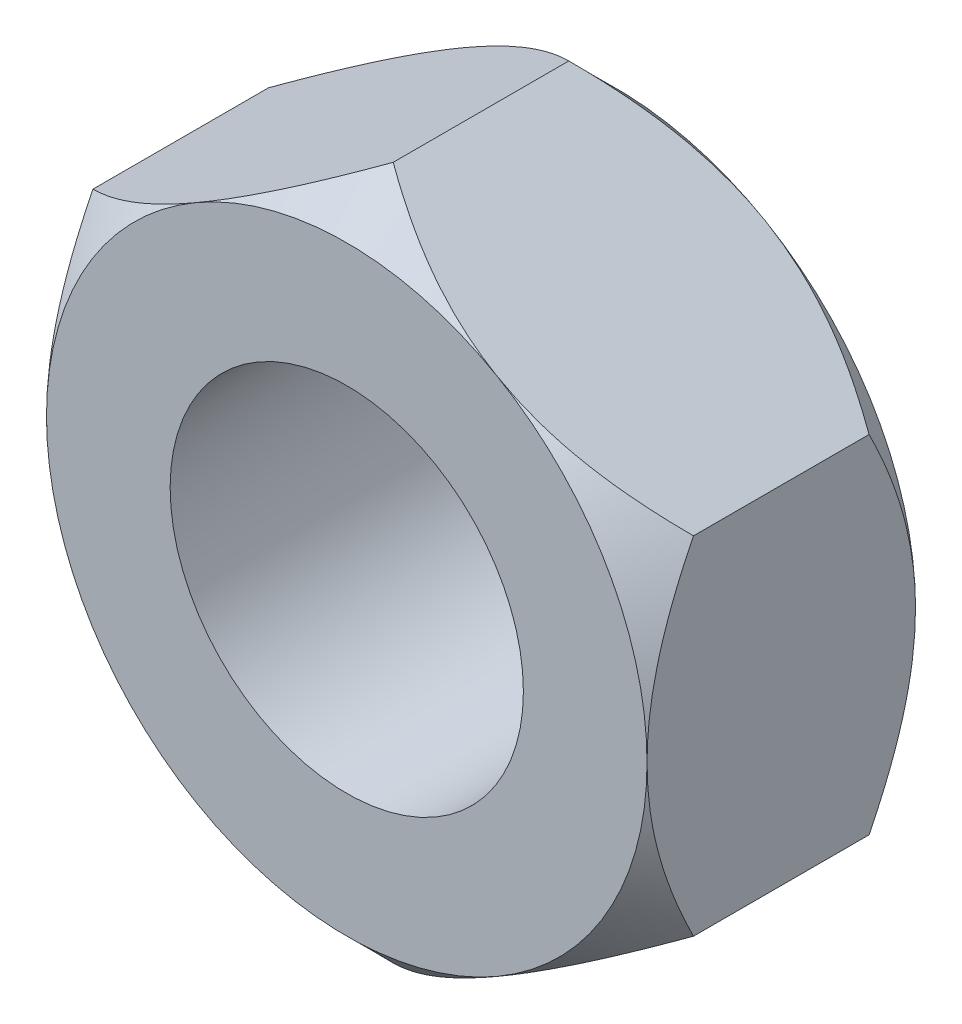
ISO-10303-21;
HEADER;
FILE_DESCRIPTION(('STEP AP214'),'2;1');
FILE_NAME('part.step','',(''),(''),'','','');
FILE_SCHEMA(('AUTOMOTIVE_DESIGN { 1 0 10303 214 1 1 1 1 }'));
ENDSEC;
DATA;
#1=APPLICATION_CONTEXT('core data for automotive mechanical design processes');
#2=APPLICATION_PROTOCOL_DEFINITION('international standard','automotive_design',2000,#1);
#3=PRODUCT_CONTEXT('',#1,'mechanical');
#4=PRODUCT('Part','Part','',(#3));
#5=PRODUCT_RELATED_PRODUCT_CATEGORY('part','',(#4));
#6=PRODUCT_DEFINITION_FORMATION('','',#4);
#7=PRODUCT_DEFINITION_CONTEXT('part definition',#1,'design');
#8=PRODUCT_DEFINITION('design','',#6,#7);
#9=PRODUCT_DEFINITION_SHAPE('','',#8);
#10=(LENGTH_UNIT() NAMED_UNIT(*) SI_UNIT(.MILLI.,.METRE.));
#11=(NAMED_UNIT(*) PLANE_ANGLE_UNIT() SI_UNIT($,.RADIAN.));
#12=(NAMED_UNIT(*) SI_UNIT($,.STERADIAN.) SOLID_ANGLE_UNIT());
#13=UNCERTAINTY_MEASURE_WITH_UNIT(LENGTH_MEASURE(1.E-05),#10,'distance_accuracy_value','');
#14=(GEOMETRIC_REPRESENTATION_CONTEXT(3) GLOBAL_UNCERTAINTY_ASSIGNED_CONTEXT((#13)) GLOBAL_UNIT_ASSIGNED_CONTEXT((#10,
#11,#12)) REPRESENTATION_CONTEXT('',''));
#15=CARTESIAN_POINT('',(0.,0.,0.));
#16=DIRECTION('',(0.,0.,1.));
#17=DIRECTION('',(1.,0.,0.));
#18=AXIS2_PLACEMENT_3D('',#15,#16,#17);
#19=CARTESIAN_POINT('',(0.,0.,-2.5));
#20=DIRECTION('',(0.,0.,1.));
#21=DIRECTION('',(0.,1.,0.));
#22=AXIS2_PLACEMENT_3D('',#19,#20,#21);
#23=CYLINDRICAL_SURFACE('',#22,5.);
#24=CARTESIAN_POINT('',(0.,0.,0.));
#25=DIRECTION('',(0.,0.,1.));
#26=DIRECTION('',(1.,0.,0.));
#27=AXIS2_PLACEMENT_3D('',#24,#25,#26);
#28=CIRCLE('',#27,5.);
#29=CARTESIAN_POINT('',(5.,0.,0.));
#30=VERTEX_POINT('',#29);
#31=EDGE_CURVE('E467',#30,#30,#28,.T.);
#32=ORIENTED_EDGE('',*,*,#31,.F.);
#33=EDGE_LOOP('',(#32));
#34=FACE_BOUND('',#33,.T.);
#35=CARTESIAN_POINT('',(0.,0.,7.6));
#36=DIRECTION('',(0.,0.,-1.));
#37=DIRECTION('',(0.5,-0.866025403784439,0.));
#38=AXIS2_PLACEMENT_3D('',#35,#36,#37);
#39=CIRCLE('',#38,5.);
#40=CARTESIAN_POINT('',(2.50000000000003,-4.3301270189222,7.6));
#41=VERTEX_POINT('',#40);
#42=EDGE_CURVE('E102',#41,#41,#39,.T.);
#43=ORIENTED_EDGE('',*,*,#42,.F.);
#44=EDGE_LOOP('',(#43));
#45=FACE_BOUND('',#44,.T.);
#46=ADVANCED_FACE('F14',(#34,#45),#23,.F.);
#47=CARTESIAN_POINT('',(0.,0.,7.6));
#48=DIRECTION('',(0.,0.,-1.));
#49=DIRECTION('',(0.5,-0.866025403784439,0.));
#50=AXIS2_PLACEMENT_3D('',#47,#48,#49);
#51=CONICAL_SURFACE('',#50,8.5,0.78539816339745);
#52=CARTESIAN_POINT('',(0.,0.,7.6));
#53=DIRECTION('',(0.,0.,-1.));
#54=DIRECTION('',(0.5,-0.866025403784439,0.));
#55=AXIS2_PLACEMENT_3D('',#52,#53,#54);
#56=CIRCLE('',#55,8.5);
#57=CARTESIAN_POINT('',(4.25,-7.36121593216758,7.6));
#58=VERTEX_POINT('',#57);
#59=CARTESIAN_POINT('',(8.5,0.,7.6));
#60=VERTEX_POINT('',#59);
#61=EDGE_CURVE('E19',#58,#60,#56,.F.);
#62=ORIENTED_EDGE('',*,*,#61,.F.);
#63=CARTESIAN_POINT('',(14.0130579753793,-1.7245117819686,1.9812275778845));
#64=CARTESIAN_POINT('',(13.7802189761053,-1.85894144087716,2.19585707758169));
#65=CARTESIAN_POINT('',(13.5462324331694,-1.99403363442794,2.40885080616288));
#66=CARTESIAN_POINT('',(13.075461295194,-2.26583347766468,2.83078857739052));
#67=CARTESIAN_POINT('',(12.8386761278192,-2.40254145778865,3.03973176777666));
#68=CARTESIAN_POINT('',(12.3600993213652,-2.67884790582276,3.45426112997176));
#69=CARTESIAN_POINT('',(12.1182833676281,-2.81846041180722,3.65980998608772));
#70=CARTESIAN_POINT('',(11.6308288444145,-3.09989241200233,4.06474862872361));
#71=CARTESIAN_POINT('',(11.3851905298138,-3.24171175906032,4.26413882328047));
#72=CARTESIAN_POINT('',(10.8700152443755,-3.53914834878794,4.67056568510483));
#73=CARTESIAN_POINT('',(10.6001101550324,-3.69497812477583,4.87698322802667));
#74=CARTESIAN_POINT('',(10.0539408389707,-4.01030912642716,5.27848742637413));
#75=CARTESIAN_POINT('',(9.77767542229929,-4.16981103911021,5.47357193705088));
#76=CARTESIAN_POINT('',(9.21849382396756,-4.49265468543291,5.84838318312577));
#77=CARTESIAN_POINT('',(8.93560019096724,-4.65598340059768,6.02815442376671));
#78=CARTESIAN_POINT('',(8.36127093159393,-4.98757255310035,6.36831250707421));
#79=CARTESIAN_POINT('',(8.06983975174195,-5.15583042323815,6.52870922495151));
#80=CARTESIAN_POINT('',(7.51664325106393,-5.47521857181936,6.80449570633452));
#81=CARTESIAN_POINT('',(7.25606672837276,-5.62566249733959,6.92303308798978));
#82=CARTESIAN_POINT('',(6.72750139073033,-5.93082983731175,7.13605479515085));
#83=CARTESIAN_POINT('',(6.45951215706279,-6.08555349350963,7.23053775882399));
#84=CARTESIAN_POINT('',(5.92290632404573,-6.39536301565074,7.38829293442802));
#85=CARTESIAN_POINT('',(5.65443402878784,-6.55036556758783,7.45220778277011));
#86=CARTESIAN_POINT('',(5.11315332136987,-6.86287412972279,7.54732895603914));
#87=CARTESIAN_POINT('',(4.84034626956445,-7.02037935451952,7.57854534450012));
#88=CARTESIAN_POINT('',(4.31084226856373,-7.32608863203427,7.60484524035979));
#89=CARTESIAN_POINT('',(4.05422653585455,-7.47424579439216,7.60210454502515));
#90=CARTESIAN_POINT('',(3.54263436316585,-7.76961367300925,7.56593881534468));
#91=CARTESIAN_POINT('',(3.28765804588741,-7.91682431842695,7.53251151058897));
#92=CARTESIAN_POINT('',(2.77681308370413,-8.21176079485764,7.43644000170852));
#93=CARTESIAN_POINT('',(2.52102494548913,-8.35944014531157,7.37323585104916));
#94=CARTESIAN_POINT('',(2.01526772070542,-8.65143921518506,7.22142496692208));
#95=CARTESIAN_POINT('',(1.7652986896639,-8.795758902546,7.13281799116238));
#96=CARTESIAN_POINT('',(1.27241605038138,-9.08032482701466,6.93483301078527));
#97=CARTESIAN_POINT('',(1.02948600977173,-9.22058055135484,6.82550879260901));
#98=CARTESIAN_POINT('',(0.549824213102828,-9.49751341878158,6.58988946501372));
#99=CARTESIAN_POINT('',(0.313095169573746,-9.63418899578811,6.46358707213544));
#100=CARTESIAN_POINT('',(-0.15523781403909,-9.90458116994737,6.19700510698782));
#101=CARTESIAN_POINT('',(-0.386823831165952,-10.0382874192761,6.05668389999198));
#102=CARTESIAN_POINT('',(-0.844709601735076,-10.3026478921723,5.76513355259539));
#103=CARTESIAN_POINT('',(-1.07101012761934,-10.4333025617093,5.61390601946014));
#104=CARTESIAN_POINT('',(-1.50792650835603,-10.685556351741,5.3103563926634));
#105=CARTESIAN_POINT('',(-1.7187645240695,-10.8072837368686,5.1584583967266));
#106=CARTESIAN_POINT('',(-2.13681796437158,-11.0486470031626,4.84813661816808));
#107=CARTESIAN_POINT('',(-2.34403312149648,-11.1682827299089,4.68971235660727));
#108=CARTESIAN_POINT('',(-2.75367159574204,-11.404787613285,4.36876442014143));
#109=CARTESIAN_POINT('',(-2.9561198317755,-11.5216711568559,4.20628299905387));
#110=CARTESIAN_POINT('',(-3.35823176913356,-11.7538305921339,3.87691751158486));
#111=CARTESIAN_POINT('',(-3.55789622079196,-11.8691069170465,3.71003466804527));
#112=CARTESIAN_POINT('',(-3.7563910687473,-11.9837079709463,3.5413483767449));
#113=B_SPLINE_CURVE_WITH_KNOTS('',3,(#63,#64,#65,#66,#67,#68,#69,#70,#71,#72,#73,#74,#75,#76,
#77,#78,#79,#80,#81,#82,#83,#84,#85,#86,#87,#88,#89,#90,#91,#92,#93,#94,#95,#96,#97,#98,#99,
#100,#101,#102,#103,#104,#105,#106,#107,#108,#109,#110,#111,#112),.UNSPECIFIED.,.F.,.F.,(4,2,2,
2,2,2,2,2,2,2,2,2,2,2,2,2,2,2,2,2,2,2,2,2,4),(0.,1.03208198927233,2.06437882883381,
3.10447900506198,4.14451012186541,5.26577260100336,6.38724658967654,7.50534131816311,
8.62286372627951,9.59224194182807,10.5616750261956,11.5097185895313,12.457470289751,
13.3448266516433,14.2322486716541,15.1370685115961,16.0418969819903,16.9444077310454,
17.8473068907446,18.7529721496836,19.6585042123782,20.5192478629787,21.3800547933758,
22.2340638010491,23.0878379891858),.UNSPECIFIED.);
#114=CARTESIAN_POINT('',(8.5,-4.90747728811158,6.2850454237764));
#115=VERTEX_POINT('',#114);
#116=EDGE_CURVE('E428',#115,#58,#113,.T.);
#117=ORIENTED_EDGE('',*,*,#116,.F.);
#118=CARTESIAN_POINT('',(8.5,4.90770822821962,6.2849299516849));
#119=CARTESIAN_POINT('',(8.5,4.73896247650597,6.369289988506));
#120=CARTESIAN_POINT('',(8.5,4.56889987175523,6.45107537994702));
#121=CARTESIAN_POINT('',(8.5,4.2259258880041,6.60868010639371));
#122=CARTESIAN_POINT('',(8.5,4.05301301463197,6.68449618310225));
#123=CARTESIAN_POINT('',(8.5,3.7033077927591,6.82966661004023));
#124=CARTESIAN_POINT('',(8.5,3.52649889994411,6.89898147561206));
#125=CARTESIAN_POINT('',(8.5,3.17001499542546,7.0296393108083));
#126=CARTESIAN_POINT('',(8.5,2.99034042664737,7.09098349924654));
#127=CARTESIAN_POINT('',(8.5,2.45264890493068,7.2596822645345));
#128=CARTESIAN_POINT('',(8.5,2.09033938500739,7.35410101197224));
#129=CARTESIAN_POINT('',(8.5,1.54099225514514,7.46330945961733));
#130=CARTESIAN_POINT('',(8.5,1.35707983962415,7.49429440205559));
#131=CARTESIAN_POINT('',(8.5,0.987691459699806,7.54476295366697));
#132=CARTESIAN_POINT('',(8.5,0.802215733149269,7.56424828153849));
#133=CARTESIAN_POINT('',(8.5,0.350234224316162,7.59691830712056));
#134=CARTESIAN_POINT('',(8.5,0.0832421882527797,7.60377264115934));
#135=CARTESIAN_POINT('',(8.5,-0.450261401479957,7.59226596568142));
#136=CARTESIAN_POINT('',(8.5,-0.716772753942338,7.57389611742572));
#137=CARTESIAN_POINT('',(8.5,-1.24728257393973,7.51302370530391));
#138=CARTESIAN_POINT('',(8.5,-1.51127789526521,7.47049415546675));
#139=CARTESIAN_POINT('',(8.5,-2.03473114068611,7.36361456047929));
#140=CARTESIAN_POINT('',(8.5,-2.2941894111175,7.29926618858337));
#141=CARTESIAN_POINT('',(8.5,-2.75476553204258,7.16688449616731));
#142=CARTESIAN_POINT('',(8.5,-2.95690341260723,7.1023333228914));
#143=CARTESIAN_POINT('',(8.5,-3.35755072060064,6.9628291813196));
#144=CARTESIAN_POINT('',(8.5,-3.55606003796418,6.88787589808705));
#145=CARTESIAN_POINT('',(8.5,-3.94882496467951,6.72924760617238));
#146=CARTESIAN_POINT('',(8.5,-4.14309174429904,6.64560002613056));
#147=CARTESIAN_POINT('',(8.5,-4.52802818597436,6.47068124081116));
#148=CARTESIAN_POINT('',(8.5,-4.71869996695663,6.37941471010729));
#149=CARTESIAN_POINT('',(8.5,-4.9077082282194,6.2849299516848));
#150=B_SPLINE_CURVE_WITH_KNOTS('',3,(#118,#119,#120,#121,#122,#123,#124,#125,#126,#127,#128,
#129,#130,#131,#132,#133,#134,#135,#136,#137,#138,#139,#140,#141,#142,#143,#144,#145,#146,#147,
#148,#149),.UNSPECIFIED.,.F.,.F.,(4,2,2,2,2,2,2,2,2,2,2,2,2,2,2,4),(0.,0.565988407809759,
1.13228364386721,1.7018214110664,2.27127198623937,3.39189520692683,3.95110786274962,
4.51023691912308,5.31023384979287,6.11051117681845,6.91168416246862,7.71279572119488,
8.34908108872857,8.98538572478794,9.61974061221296,10.2537091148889),.UNSPECIFIED.);
#151=EDGE_CURVE('E112',#60,#115,#150,.T.);
#152=ORIENTED_EDGE('',*,*,#151,.F.);
#153=EDGE_LOOP('',(#62,#117,#152));
#154=FACE_BOUND('',#153,.T.);
#155=ADVANCED_FACE('F145',(#154),#51,.T.);
#156=CARTESIAN_POINT('',(0.,0.,7.6));
#157=DIRECTION('',(0.,0.,-1.));
#158=DIRECTION('',(0.5,-0.866025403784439,0.));
#159=AXIS2_PLACEMENT_3D('',#156,#157,#158);
#160=CIRCLE('',#159,8.5);
#161=CARTESIAN_POINT('',(-4.25,-7.36121593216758,7.6));
#162=VERTEX_POINT('',#161);
#163=EDGE_CURVE('E119',#58,#162,#160,.T.);
#164=ORIENTED_EDGE('',*,*,#163,.T.);
#165=CARTESIAN_POINT('',(0.000200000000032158,-9.81507004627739,6.2849299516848));
#166=CARTESIAN_POINT('',(-0.145938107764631,-9.73069717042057,6.36928998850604));
#167=CARTESIAN_POINT('',(-0.293216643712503,-9.6456658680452,6.45107537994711));
#168=CARTESIAN_POINT('',(-0.590240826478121,-9.47417887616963,6.60868010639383));
#169=CARTESIAN_POINT('',(-0.739987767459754,-9.38772243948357,6.68449618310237));
#170=CARTESIAN_POINT('',(-1.04284137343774,-9.21286982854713,6.82966661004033));
#171=CARTESIAN_POINT('',(-1.19596236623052,-9.12446538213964,6.89898147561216));
#172=CARTESIAN_POINT('',(-1.50468648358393,-8.94622342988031,7.0296393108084));
#173=CARTESIAN_POINT('',(-1.66028922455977,-8.85638614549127,7.09098349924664));
#174=CARTESIAN_POINT('',(-2.12594374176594,-8.58754038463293,7.2596822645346));
#175=CARTESIAN_POINT('',(-2.43971299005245,-8.40638562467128,7.35410101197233));
#176=CARTESIAN_POINT('',(-2.91546156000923,-8.13171205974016,7.46330945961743));
#177=CARTESIAN_POINT('',(-3.07473438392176,-8.03975585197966,7.4942944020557));
#178=CARTESIAN_POINT('',(-3.39463410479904,-7.85506166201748,7.54476295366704));
#179=CARTESIAN_POINT('',(-3.55526079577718,-7.76232379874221,7.5642482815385));
#180=CARTESIAN_POINT('',(-3.94668826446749,-7.53633304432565,7.59691830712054));
#181=CARTESIAN_POINT('',(-4.17791015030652,-7.40283702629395,7.60377264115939));
#182=CARTESIAN_POINT('',(-4.63993781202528,-7.13608523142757,7.59226596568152));
#183=CARTESIAN_POINT('',(-4.87074341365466,-7.00282955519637,7.57389611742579));
#184=CARTESIAN_POINT('',(-5.33017839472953,-6.73757464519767,7.51302370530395));
#185=CARTESIAN_POINT('',(-5.55880504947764,-6.60557698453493,7.47049415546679));
#186=CARTESIAN_POINT('',(-6.01212885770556,-6.34385036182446,7.36361456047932));
#187=CARTESIAN_POINT('',(-6.23682631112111,-6.21412122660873,7.29926618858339));
#188=CARTESIAN_POINT('',(-6.63569693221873,-5.9838331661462,7.16688449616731));
#189=CARTESIAN_POINT('',(-6.81075347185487,-5.8827642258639,7.1023333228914));
#190=CARTESIAN_POINT('',(-7.15772421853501,-5.68244057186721,6.96282918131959));
#191=CARTESIAN_POINT('',(-7.32963833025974,-5.58318591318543,6.88787589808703));
#192=CARTESIAN_POINT('',(-7.66978273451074,-5.38680344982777,6.72924760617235));
#193=CARTESIAN_POINT('',(-7.83802270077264,-5.28967006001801,6.64560002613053));
#194=CARTESIAN_POINT('',(-8.17138743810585,-5.09720183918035,6.47068124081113));
#195=CARTESIAN_POINT('',(-8.33651404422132,-5.0018659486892,6.37941471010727));
#196=CARTESIAN_POINT('',(-8.5002,-4.90736181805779,6.2849299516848));
#197=B_SPLINE_CURVE_WITH_KNOTS('',3,(#165,#166,#167,#168,#169,#170,#171,#172,#173,#174,#175,
#176,#177,#178,#179,#180,#181,#182,#183,#184,#185,#186,#187,#188,#189,#190,#191,#192,#193,#194,
#195,#196),.UNSPECIFIED.,.F.,.F.,(4,2,2,2,2,2,2,2,2,2,2,2,2,2,2,4),(0.,0.565988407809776,
1.13228364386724,1.70182141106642,2.27127198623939,3.39189520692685,3.95110786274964,
4.51023691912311,5.31023384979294,6.11051117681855,6.91168416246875,7.71279572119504,
8.34908108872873,8.9853857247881,9.61974061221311,10.2537091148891),.UNSPECIFIED.);
#198=CARTESIAN_POINT('',(0.,-9.8149545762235,6.2850454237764));
#199=VERTEX_POINT('',#198);
#200=EDGE_CURVE('E175',#199,#162,#197,.T.);
#201=ORIENTED_EDGE('',*,*,#200,.F.);
#202=EDGE_CURVE('E177',#58,#199,#113,.T.);
#203=ORIENTED_EDGE('',*,*,#202,.F.);
#204=EDGE_LOOP('',(#164,#201,#203));
#205=FACE_BOUND('',#204,.T.);
#206=ADVANCED_FACE('F256',(#205),#51,.T.);
#207=CARTESIAN_POINT('',(-8.5,0.,7.6));
#208=VERTEX_POINT('',#207);
#209=EDGE_CURVE('E232',#208,#162,#56,.F.);
#210=ORIENTED_EDGE('',*,*,#209,.F.);
#211=CARTESIAN_POINT('',(-8.5,-4.9077082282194,6.2849299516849));
#212=CARTESIAN_POINT('',(-8.5,-4.73896247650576,6.36928998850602));
#213=CARTESIAN_POINT('',(-8.5,-4.56889987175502,6.45107537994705));
#214=CARTESIAN_POINT('',(-8.5,-4.2259258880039,6.60868010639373));
#215=CARTESIAN_POINT('',(-8.5,-4.05301301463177,6.68449618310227));
#216=CARTESIAN_POINT('',(-8.5,-3.7033077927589,6.82966661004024));
#217=CARTESIAN_POINT('',(-8.5,-3.5264988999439,6.89898147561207));
#218=CARTESIAN_POINT('',(-8.5,-3.17001499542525,7.0296393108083));
#219=CARTESIAN_POINT('',(-8.5,-2.99034042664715,7.09098349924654));
#220=CARTESIAN_POINT('',(-8.5,-2.45264890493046,7.2596822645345));
#221=CARTESIAN_POINT('',(-8.5,-2.09033938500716,7.35410101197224));
#222=CARTESIAN_POINT('',(-8.5,-1.54099225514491,7.4633094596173));
#223=CARTESIAN_POINT('',(-8.5,-1.35707983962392,7.49429440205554));
#224=CARTESIAN_POINT('',(-8.5,-0.987691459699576,7.54476295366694));
#225=CARTESIAN_POINT('',(-8.5,-0.802215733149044,7.56424828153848));
#226=CARTESIAN_POINT('',(-8.5,-0.350234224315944,7.59691830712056));
#227=CARTESIAN_POINT('',(-8.5,-0.0832421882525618,7.60377264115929));
#228=CARTESIAN_POINT('',(-8.5,0.450261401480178,7.59226596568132));
#229=CARTESIAN_POINT('',(-8.5,0.716772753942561,7.57389611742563));
#230=CARTESIAN_POINT('',(-8.5,1.24728257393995,7.5130237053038));
#231=CARTESIAN_POINT('',(-8.5,1.51127789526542,7.4704941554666));
#232=CARTESIAN_POINT('',(-8.5,2.03473114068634,7.36361456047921));
#233=CARTESIAN_POINT('',(-8.5,2.29418941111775,7.29926618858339));
#234=CARTESIAN_POINT('',(-8.5,2.7547655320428,7.1668844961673));
#235=CARTESIAN_POINT('',(-8.5,2.95690341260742,7.1023333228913));
#236=CARTESIAN_POINT('',(-8.5,3.35755072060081,6.96282918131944));
#237=CARTESIAN_POINT('',(-8.5,3.55606003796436,6.8878758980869));
#238=CARTESIAN_POINT('',(-8.5,3.94882496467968,6.72924760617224));
#239=CARTESIAN_POINT('',(-8.5,4.1430917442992,6.64560002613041));
#240=CARTESIAN_POINT('',(-8.5,4.52802818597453,6.47068124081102));
#241=CARTESIAN_POINT('',(-8.5,4.71869996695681,6.37941471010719));
#242=CARTESIAN_POINT('',(-8.5,4.90770822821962,6.2849299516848));
#243=B_SPLINE_CURVE_WITH_KNOTS('',3,(#211,#212,#213,#214,#215,#216,#217,#218,#219,#220,#221,
#222,#223,#224,#225,#226,#227,#228,#229,#230,#231,#232,#233,#234,#235,#236,#237,#238,#239,#240,
#241,#242),.UNSPECIFIED.,.F.,.F.,(4,2,2,2,2,2,2,2,2,2,2,2,2,2,2,4),(0.,0.565988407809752,
1.1322836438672,1.7018214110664,2.27127198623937,3.39189520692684,3.95110786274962,
4.51023691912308,5.31023384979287,6.11051117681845,6.91168416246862,7.71279572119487,
8.34908108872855,8.98538572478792,9.61974061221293,10.2537091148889),.UNSPECIFIED.);
#244=CARTESIAN_POINT('',(-8.5,-4.90747728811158,6.2850454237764));
#245=VERTEX_POINT('',#244);
#246=EDGE_CURVE('E176',#245,#208,#243,.T.);
#247=ORIENTED_EDGE('',*,*,#246,.F.);
#248=EDGE_CURVE('E168',#162,#245,#197,.T.);
#249=ORIENTED_EDGE('',*,*,#248,.F.);
#250=EDGE_LOOP('',(#210,#247,#249));
#251=FACE_BOUND('',#250,.T.);
#252=ADVANCED_FACE('F399',(#251),#51,.T.);
#253=CARTESIAN_POINT('',(-4.25,7.36121593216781,7.6));
#254=VERTEX_POINT('',#253);
#255=EDGE_CURVE('E235',#254,#208,#56,.F.);
#256=ORIENTED_EDGE('',*,*,#255,.F.);
#257=CARTESIAN_POINT('',(5.5130579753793,12.997920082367,1.9812275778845));
#258=CARTESIAN_POINT('',(5.28021897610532,12.8634904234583,2.1958570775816));
#259=CARTESIAN_POINT('',(5.04623243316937,12.7283982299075,2.40885080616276));
#260=CARTESIAN_POINT('',(4.57546129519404,12.4565983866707,2.83078857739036));
#261=CARTESIAN_POINT('',(4.33867612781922,12.3198904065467,3.03973176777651));
#262=CARTESIAN_POINT('',(3.86009932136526,12.0435839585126,3.45426112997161));
#263=CARTESIAN_POINT('',(3.61828336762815,11.9039714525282,3.65980998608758));
#264=CARTESIAN_POINT('',(3.13082884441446,11.6225394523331,4.06474862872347));
#265=CARTESIAN_POINT('',(2.88519052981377,11.4807201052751,4.26413882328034));
#266=CARTESIAN_POINT('',(2.3700152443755,11.1832835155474,4.6705656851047));
#267=CARTESIAN_POINT('',(2.1001101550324,11.0274537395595,4.87698322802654));
#268=CARTESIAN_POINT('',(1.55394083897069,10.7121227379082,5.27848742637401));
#269=CARTESIAN_POINT('',(1.27767542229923,10.5526208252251,5.47357193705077));
#270=CARTESIAN_POINT('',(0.718493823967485,10.2297771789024,5.84838318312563));
#271=CARTESIAN_POINT('',(0.435600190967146,10.0664484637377,6.02815442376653));
#272=CARTESIAN_POINT('',(-0.138729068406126,9.73485931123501,6.36831250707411));
#273=CARTESIAN_POINT('',(-0.430160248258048,9.56660144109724,6.52870922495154));
#274=CARTESIAN_POINT('',(-0.98335674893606,9.24721329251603,6.8044957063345));
#275=CARTESIAN_POINT('',(-1.24393327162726,9.09676936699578,6.92303308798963));
#276=CARTESIAN_POINT('',(-1.77249860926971,8.79160202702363,7.13605479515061));
#277=CARTESIAN_POINT('',(-2.04048784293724,8.63687837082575,7.23053775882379));
#278=CARTESIAN_POINT('',(-2.57709367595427,8.32706884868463,7.3882929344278));
#279=CARTESIAN_POINT('',(-2.84556597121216,8.17206629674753,7.45220778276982));
#280=CARTESIAN_POINT('',(-3.38684667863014,7.85955773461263,7.54732895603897));
#281=CARTESIAN_POINT('',(-3.65965373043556,7.70205250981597,7.57854534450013));
#282=CARTESIAN_POINT('',(-4.18915773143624,7.39634323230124,7.60484524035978));
#283=CARTESIAN_POINT('',(-4.44577346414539,7.2481860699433,7.60210454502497));
#284=CARTESIAN_POINT('',(-4.95736563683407,6.95281819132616,7.56593881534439));
#285=CARTESIAN_POINT('',(-5.21234195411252,6.80560754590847,7.53251151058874));
#286=CARTESIAN_POINT('',(-5.72318691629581,6.5106710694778,7.43644000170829));
#287=CARTESIAN_POINT('',(-5.9789750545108,6.36299171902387,7.37323585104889));
#288=CARTESIAN_POINT('',(-6.48473227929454,6.07099264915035,7.22142496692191));
#289=CARTESIAN_POINT('',(-6.7347013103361,5.92667296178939,7.13281799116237));
#290=CARTESIAN_POINT('',(-7.22758394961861,5.64210703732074,6.93483301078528));
#291=CARTESIAN_POINT('',(-7.47051399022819,5.50185131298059,6.82550879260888));
#292=CARTESIAN_POINT('',(-7.95017578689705,5.22491844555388,6.58988946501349));
#293=CARTESIAN_POINT('',(-8.18690483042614,5.08824286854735,6.46358707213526));
#294=CARTESIAN_POINT('',(-8.65523781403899,4.81785069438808,6.19700510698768));
#295=CARTESIAN_POINT('',(-8.88682383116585,4.68414444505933,6.05668389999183));
#296=CARTESIAN_POINT('',(-9.34470960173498,4.41978397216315,5.76513355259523));
#297=CARTESIAN_POINT('',(-9.57101012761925,4.28912930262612,5.61390601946));
#298=CARTESIAN_POINT('',(-10.0079265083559,4.03687551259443,5.31035639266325));
#299=CARTESIAN_POINT('',(-10.2187645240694,3.91514812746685,5.15845839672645));
#300=CARTESIAN_POINT('',(-10.6368179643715,3.67378486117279,4.84813661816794));
#301=CARTESIAN_POINT('',(-10.8440331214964,3.55414913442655,4.68971235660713));
#302=CARTESIAN_POINT('',(-11.253671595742,3.31764425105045,4.36876442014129));
#303=CARTESIAN_POINT('',(-11.4561198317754,3.20076070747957,4.20628299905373));
#304=CARTESIAN_POINT('',(-11.8582317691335,2.96860127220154,3.87691751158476));
#305=CARTESIAN_POINT('',(-12.0578962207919,2.85332494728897,3.7100346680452));
#306=CARTESIAN_POINT('',(-12.2563910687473,2.73872389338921,3.5413483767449));
#307=B_SPLINE_CURVE_WITH_KNOTS('',3,(#257,#258,#259,#260,#261,#262,#263,#264,#265,#266,#267,
#268,#269,#270,#271,#272,#273,#274,#275,#276,#277,#278,#279,#280,#281,#282,#283,#284,#285,#286,
#287,#288,#289,#290,#291,#292,#293,#294,#295,#296,#297,#298,#299,#300,#301,#302,#303,#304,#305,
#306),.UNSPECIFIED.,.F.,.F.,(4,2,2,2,2,2,2,2,2,2,2,2,2,2,2,2,2,2,2,2,2,2,2,2,4),(0.,
1.03208198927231,2.06437882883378,3.10447900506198,4.14451012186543,5.26577260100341,
6.38724658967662,7.50534131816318,8.62286372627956,9.59224194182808,10.5616750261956,
11.5097185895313,12.4574702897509,13.3448266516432,14.232248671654,15.137068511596,
16.0418969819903,16.9444077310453,17.8473068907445,18.7529721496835,19.658504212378,
20.5192478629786,21.3800547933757,22.234063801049,23.0878379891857),.UNSPECIFIED.);
#308=CARTESIAN_POINT('',(-8.5,4.90747728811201,6.2850454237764));
#309=VERTEX_POINT('',#308);
#310=EDGE_CURVE('E437',#309,#254,#307,.F.);
#311=ORIENTED_EDGE('',*,*,#310,.F.);
#312=EDGE_CURVE('E161',#208,#309,#243,.T.);
#313=ORIENTED_EDGE('',*,*,#312,.F.);
#314=EDGE_LOOP('',(#256,#311,#313));
#315=FACE_BOUND('',#314,.T.);
#316=ADVANCED_FACE('F144',(#315),#51,.T.);
#317=CARTESIAN_POINT('',(-0.000199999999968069,9.81507004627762,6.2849299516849));
#318=CARTESIAN_POINT('',(0.14593810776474,9.73069717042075,6.36928998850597));
#319=CARTESIAN_POINT('',(0.293216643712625,9.64566586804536,6.45107537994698));
#320=CARTESIAN_POINT('',(0.590240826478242,9.47417887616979,6.60868010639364));
#321=CARTESIAN_POINT('',(0.739987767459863,9.38772243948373,6.68449618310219));
#322=CARTESIAN_POINT('',(1.04284137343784,9.2128698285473,6.82966661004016));
#323=CARTESIAN_POINT('',(1.19596236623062,9.12446538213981,6.898981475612));
#324=CARTESIAN_POINT('',(1.50468648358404,8.94622342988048,7.02963931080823));
#325=CARTESIAN_POINT('',(1.66028922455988,8.85638614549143,7.09098349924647));
#326=CARTESIAN_POINT('',(2.12594374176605,8.58754038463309,7.25968226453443));
#327=CARTESIAN_POINT('',(2.43971299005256,8.40638562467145,7.35410101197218));
#328=CARTESIAN_POINT('',(2.91546156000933,8.13171205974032,7.46330945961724));
#329=CARTESIAN_POINT('',(3.07473438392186,8.03975585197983,7.49429440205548));
#330=CARTESIAN_POINT('',(3.39463410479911,7.85506166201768,7.54476295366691));
#331=CARTESIAN_POINT('',(3.55526079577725,7.76232379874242,7.56424828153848));
#332=CARTESIAN_POINT('',(3.94668826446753,7.53633304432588,7.59691830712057));
#333=CARTESIAN_POINT('',(4.17791015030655,7.40283702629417,7.60377264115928));
#334=CARTESIAN_POINT('',(4.6399378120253,7.13608523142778,7.59226596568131));
#335=CARTESIAN_POINT('',(4.87074341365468,7.0028295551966,7.57389611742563));
#336=CARTESIAN_POINT('',(5.33017839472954,6.73757464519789,7.51302370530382));
#337=CARTESIAN_POINT('',(5.55880504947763,6.60557698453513,7.47049415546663));
#338=CARTESIAN_POINT('',(6.01212885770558,6.34385036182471,7.36361456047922));
#339=CARTESIAN_POINT('',(6.2368263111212,6.21412122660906,7.29926618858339));
#340=CARTESIAN_POINT('',(6.63569693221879,5.98383316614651,7.1668844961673));
#341=CARTESIAN_POINT('',(6.81075347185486,5.88276422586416,7.10233332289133));
#342=CARTESIAN_POINT('',(7.15772421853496,5.68244057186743,6.96282918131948));
#343=CARTESIAN_POINT('',(7.32963833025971,5.58318591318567,6.88787589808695));
#344=CARTESIAN_POINT('',(7.66978273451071,5.38680344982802,6.7292476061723));
#345=CARTESIAN_POINT('',(7.83802270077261,5.28967006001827,6.64560002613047));
#346=CARTESIAN_POINT('',(8.17138743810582,5.09720183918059,6.47068124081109));
#347=CARTESIAN_POINT('',(8.33651404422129,5.00186594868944,6.37941471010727));
#348=CARTESIAN_POINT('',(8.5002,4.90736181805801,6.2849299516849));
#349=B_SPLINE_CURVE_WITH_KNOTS('',3,(#317,#318,#319,#320,#321,#322,#323,#324,#325,#326,#327,
#328,#329,#330,#331,#332,#333,#334,#335,#336,#337,#338,#339,#340,#341,#342,#343,#344,#345,#346,
#347,#348),.UNSPECIFIED.,.F.,.F.,(4,2,2,2,2,2,2,2,2,2,2,2,2,2,2,4),(0.,0.56598840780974,
1.13228364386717,1.70182141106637,2.27127198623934,3.39189520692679,3.95110786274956,
4.510236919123,5.3102338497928,6.1105111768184,6.91168416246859,7.71279572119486,
8.34908108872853,8.98538572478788,9.61974061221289,10.2537091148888),.UNSPECIFIED.);
#350=CARTESIAN_POINT('',(4.25,7.36121593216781,7.6));
#351=VERTEX_POINT('',#350);
#352=CARTESIAN_POINT('',(8.5,4.90747728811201,6.2850454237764));
#353=VERTEX_POINT('',#352);
#354=EDGE_CURVE('E107',#351,#353,#349,.T.);
#355=ORIENTED_EDGE('',*,*,#354,.F.);
#356=EDGE_CURVE('E110',#60,#351,#56,.F.);
#357=ORIENTED_EDGE('',*,*,#356,.F.);
#358=EDGE_CURVE('E94',#353,#60,#150,.T.);
#359=ORIENTED_EDGE('',*,*,#358,.F.);
#360=EDGE_LOOP('',(#355,#357,#359));
#361=FACE_BOUND('',#360,.T.);
#362=ADVANCED_FACE('F106',(#361),#51,.T.);
#363=EDGE_CURVE('E433',#351,#254,#56,.F.);
#364=ORIENTED_EDGE('',*,*,#363,.F.);
#365=CARTESIAN_POINT('',(0.,9.81495457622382,6.2850454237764));
#366=VERTEX_POINT('',#365);
#367=EDGE_CURVE('E118',#366,#351,#349,.T.);
#368=ORIENTED_EDGE('',*,*,#367,.F.);
#369=EDGE_CURVE('E121',#254,#366,#307,.F.);
#370=ORIENTED_EDGE('',*,*,#369,.F.);
#371=EDGE_LOOP('',(#364,#368,#370));
#372=FACE_BOUND('',#371,.T.);
#373=ADVANCED_FACE('F143',(#372),#51,.T.);
#374=CARTESIAN_POINT('',(4.25,7.36121593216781,0.));
#375=DIRECTION('',(-0.5,-0.866025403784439,0.));
#376=DIRECTION('',(-0.866025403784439,0.5,0.));
#377=AXIS2_PLACEMENT_3D('',#374,#375,#376);
#378=PLANE('',#377);
#379=CARTESIAN_POINT('',(-0.000199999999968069,9.81507004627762,1.3150700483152));
#380=CARTESIAN_POINT('',(0.145938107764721,9.73069717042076,1.23071001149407));
#381=CARTESIAN_POINT('',(0.293216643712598,9.64566586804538,1.14892462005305));
#382=CARTESIAN_POINT('',(0.590240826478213,9.47417887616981,0.991319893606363));
#383=CARTESIAN_POINT('',(0.739987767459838,9.38772243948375,0.91550381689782));
#384=CARTESIAN_POINT('',(1.04284137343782,9.21286982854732,0.77033338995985));
#385=CARTESIAN_POINT('',(1.1959623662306,9.12446538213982,0.701018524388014));
#386=CARTESIAN_POINT('',(1.50468648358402,8.94622342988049,0.57036068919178));
#387=CARTESIAN_POINT('',(1.66028922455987,8.85638614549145,0.50901650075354));
#388=CARTESIAN_POINT('',(2.12594374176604,8.5875403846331,0.340317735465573));
#389=CARTESIAN_POINT('',(2.43971299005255,8.40638562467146,0.24589898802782));
#390=CARTESIAN_POINT('',(2.91546156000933,8.13171205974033,0.13669054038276));
#391=CARTESIAN_POINT('',(3.07473438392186,8.03975585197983,0.105705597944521));
#392=CARTESIAN_POINT('',(3.39463410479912,7.85506166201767,0.0552370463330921));
#393=CARTESIAN_POINT('',(3.55526079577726,7.76232379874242,0.0357517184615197));
#394=CARTESIAN_POINT('',(3.94668826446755,7.53633304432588,0.00308169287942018));
#395=CARTESIAN_POINT('',(4.17791015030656,7.40283702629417,-0.00377264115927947));
#396=CARTESIAN_POINT('',(4.6399378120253,7.13608523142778,0.00773403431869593));
#397=CARTESIAN_POINT('',(4.87074341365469,7.00282955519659,0.0261038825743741));
#398=CARTESIAN_POINT('',(5.33017839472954,6.73757464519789,0.0869762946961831));
#399=CARTESIAN_POINT('',(5.55880504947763,6.60557698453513,0.129505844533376));
#400=CARTESIAN_POINT('',(6.01212885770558,6.34385036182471,0.23638543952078));
#401=CARTESIAN_POINT('',(6.2368263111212,6.21412122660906,0.300733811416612));
#402=CARTESIAN_POINT('',(6.63569693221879,5.98383316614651,0.433115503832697));
#403=CARTESIAN_POINT('',(6.81075347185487,5.88276422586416,0.497666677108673));
#404=CARTESIAN_POINT('',(7.15772421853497,5.68244057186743,0.637170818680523));
#405=CARTESIAN_POINT('',(7.32963833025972,5.58318591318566,0.712124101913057));
#406=CARTESIAN_POINT('',(7.66978273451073,5.38680344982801,0.870752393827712));
#407=CARTESIAN_POINT('',(7.83802270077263,5.28967006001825,0.95439997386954));
#408=CARTESIAN_POINT('',(8.17138743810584,5.09720183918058,1.12931875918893));
#409=CARTESIAN_POINT('',(8.33651404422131,5.00186594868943,1.22058528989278));
#410=CARTESIAN_POINT('',(8.5002,4.90736181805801,1.3150700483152));
#411=B_SPLINE_CURVE_WITH_KNOTS('',3,(#379,#380,#381,#382,#383,#384,#385,#386,#387,#388,#389,
#390,#391,#392,#393,#394,#395,#396,#397,#398,#399,#400,#401,#402,#403,#404,#405,#406,#407,#408,
#409,#410),.UNSPECIFIED.,.F.,.F.,(4,2,2,2,2,2,2,2,2,2,2,2,2,2,2,4),(0.,0.565988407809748,
1.13228364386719,1.70182141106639,2.27127198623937,3.39189520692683,3.95110786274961,
4.51023691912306,5.31023384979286,6.11051117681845,6.91168416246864,7.71279572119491,
8.34908108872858,8.98538572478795,9.61974061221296,10.2537091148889),.UNSPECIFIED.);
#412=CARTESIAN_POINT('',(0.,9.81495457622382,1.3149545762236));
#413=VERTEX_POINT('',#412);
#414=CARTESIAN_POINT('',(4.25,7.36121593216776,0.));
#415=VERTEX_POINT('',#414);
#416=EDGE_CURVE('E466',#413,#415,#411,.T.);
#417=ORIENTED_EDGE('',*,*,#416,.F.);
#418=DIRECTION('',(0.,0.,1.));
#419=VECTOR('',#418,1.);
#420=CARTESIAN_POINT('',(0.,9.81495457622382,0.));
#421=LINE('',#420,#419);
#422=EDGE_CURVE('E101',#413,#366,#421,.T.);
#423=ORIENTED_EDGE('',*,*,#422,.T.);
#424=ORIENTED_EDGE('',*,*,#367,.T.);
#425=ORIENTED_EDGE('',*,*,#354,.T.);
#426=DIRECTION('',(0.,0.,1.));
#427=VECTOR('',#426,1.);
#428=CARTESIAN_POINT('',(8.5,4.90747728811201,0.));
#429=LINE('',#428,#427);
#430=CARTESIAN_POINT('',(8.5,4.90747728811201,1.3149545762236));
#431=VERTEX_POINT('',#430);
#432=EDGE_CURVE('E91',#431,#353,#429,.T.);
#433=ORIENTED_EDGE('',*,*,#432,.F.);
#434=EDGE_CURVE('E461',#415,#431,#411,.T.);
#435=ORIENTED_EDGE('',*,*,#434,.F.);
#436=EDGE_LOOP('',(#417,#423,#424,#425,#433,#435));
#437=FACE_BOUND('',#436,.T.);
#438=ADVANCED_FACE('F116',(#437),#378,.F.);
#439=CARTESIAN_POINT('',(-4.25,7.36121593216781,0.));
#440=DIRECTION('',(0.5,-0.866025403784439,0.));
#441=DIRECTION('',(0.,0.,1.));
#442=AXIS2_PLACEMENT_3D('',#439,#440,#441);
#443=PLANE('',#442);
#444=CARTESIAN_POINT('',(5.5130579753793,12.997920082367,5.6187724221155));
#445=CARTESIAN_POINT('',(5.28021897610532,12.8634904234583,5.4041429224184));
#446=CARTESIAN_POINT('',(5.04623243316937,12.7283982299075,5.19114919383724));
#447=CARTESIAN_POINT('',(4.57546129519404,12.4565983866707,4.76921142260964));
#448=CARTESIAN_POINT('',(4.33867612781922,12.3198904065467,4.56026823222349));
#449=CARTESIAN_POINT('',(3.86009932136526,12.0435839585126,4.14573887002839));
#450=CARTESIAN_POINT('',(3.61828336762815,11.9039714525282,3.94019001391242));
#451=CARTESIAN_POINT('',(3.13082884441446,11.6225394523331,3.53525137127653));
#452=CARTESIAN_POINT('',(2.88519052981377,11.4807201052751,3.33586117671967));
#453=CARTESIAN_POINT('',(2.3700152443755,11.1832835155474,2.9294343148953));
#454=CARTESIAN_POINT('',(2.1001101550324,11.0274537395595,2.72301677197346));
#455=CARTESIAN_POINT('',(1.55394083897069,10.7121227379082,2.32151257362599));
#456=CARTESIAN_POINT('',(1.27767542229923,10.5526208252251,2.12642806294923));
#457=CARTESIAN_POINT('',(0.718493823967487,10.2297771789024,1.75161681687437));
#458=CARTESIAN_POINT('',(0.435600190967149,10.0664484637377,1.57184557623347));
#459=CARTESIAN_POINT('',(-0.138729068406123,9.73485931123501,1.23168749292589));
#460=CARTESIAN_POINT('',(-0.430160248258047,9.56660144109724,1.07129077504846));
#461=CARTESIAN_POINT('',(-0.98335674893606,9.24721329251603,0.7955042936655));
#462=CARTESIAN_POINT('',(-1.24393327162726,9.09676936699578,0.676966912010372));
#463=CARTESIAN_POINT('',(-1.7724986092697,8.79160202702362,0.463945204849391));
#464=CARTESIAN_POINT('',(-2.04048784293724,8.63687837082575,0.369462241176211));
#465=CARTESIAN_POINT('',(-2.57709367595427,8.32706884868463,0.211707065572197));
#466=CARTESIAN_POINT('',(-2.84556597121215,8.17206629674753,0.147792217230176));
#467=CARTESIAN_POINT('',(-3.38684667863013,7.85955773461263,0.0526710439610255));
#468=CARTESIAN_POINT('',(-3.65965373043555,7.70205250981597,0.0214546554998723));
#469=CARTESIAN_POINT('',(-4.18915773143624,7.39634323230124,-0.00484524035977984));
#470=CARTESIAN_POINT('',(-4.44577346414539,7.24818606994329,-0.00210454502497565));
#471=CARTESIAN_POINT('',(-4.95736563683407,6.95281819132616,0.0340611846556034));
#472=CARTESIAN_POINT('',(-5.21234195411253,6.80560754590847,0.0674884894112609));
#473=CARTESIAN_POINT('',(-5.72318691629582,6.51067106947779,0.163559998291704));
#474=CARTESIAN_POINT('',(-5.97897505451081,6.36299171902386,0.226764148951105));
#475=CARTESIAN_POINT('',(-6.48473227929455,6.07099264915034,0.378575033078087));
#476=CARTESIAN_POINT('',(-6.7347013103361,5.92667296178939,0.46718200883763));
#477=CARTESIAN_POINT('',(-7.22758394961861,5.64210703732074,0.665166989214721));
#478=CARTESIAN_POINT('',(-7.47051399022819,5.50185131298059,0.77449120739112));
#479=CARTESIAN_POINT('',(-7.95017578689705,5.22491844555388,1.0101105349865));
#480=CARTESIAN_POINT('',(-8.18690483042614,5.08824286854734,1.13641292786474));
#481=CARTESIAN_POINT('',(-8.65523781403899,4.81785069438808,1.40299489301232));
#482=CARTESIAN_POINT('',(-8.88682383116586,4.68414444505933,1.54331610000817));
#483=CARTESIAN_POINT('',(-9.34470960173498,4.41978397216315,1.83486644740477));
#484=CARTESIAN_POINT('',(-9.57101012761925,4.28912930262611,1.98609398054));
#485=CARTESIAN_POINT('',(-10.0079265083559,4.03687551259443,2.28964360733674));
#486=CARTESIAN_POINT('',(-10.2187645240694,3.91514812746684,2.44154160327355));
#487=CARTESIAN_POINT('',(-10.6368179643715,3.67378486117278,2.75186338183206));
#488=CARTESIAN_POINT('',(-10.8440331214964,3.55414913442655,2.91028764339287));
#489=CARTESIAN_POINT('',(-11.253671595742,3.31764425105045,3.23123557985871));
#490=CARTESIAN_POINT('',(-11.4561198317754,3.20076070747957,3.39371700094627));
#491=CARTESIAN_POINT('',(-11.8582317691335,2.96860127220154,3.72308248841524));
#492=CARTESIAN_POINT('',(-12.0578962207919,2.85332494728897,3.8899653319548));
#493=CARTESIAN_POINT('',(-12.2563910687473,2.73872389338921,4.0586516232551));
#494=B_SPLINE_CURVE_WITH_KNOTS('',3,(#444,#445,#446,#447,#448,#449,#450,#451,#452,#453,#454,
#455,#456,#457,#458,#459,#460,#461,#462,#463,#464,#465,#466,#467,#468,#469,#470,#471,#472,#473,
#474,#475,#476,#477,#478,#479,#480,#481,#482,#483,#484,#485,#486,#487,#488,#489,#490,#491,#492,
#493),.UNSPECIFIED.,.F.,.F.,(4,2,2,2,2,2,2,2,2,2,2,2,2,2,2,2,2,2,2,2,2,2,2,2,4),(0.,
1.03208198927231,2.06437882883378,3.10447900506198,4.14451012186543,5.2657726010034,
6.38724658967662,7.50534131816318,8.62286372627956,9.59224194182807,10.5616750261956,
11.5097185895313,12.4574702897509,13.3448266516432,14.232248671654,15.137068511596,
16.0418969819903,16.9444077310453,17.8473068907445,18.7529721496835,19.658504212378,
20.5192478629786,21.3800547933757,22.234063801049,23.0878379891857),.UNSPECIFIED.);
#495=CARTESIAN_POINT('',(-8.5,4.90747728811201,1.3149545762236));
#496=VERTEX_POINT('',#495);
#497=CARTESIAN_POINT('',(-4.25,7.36121593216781,0.));
#498=VERTEX_POINT('',#497);
#499=EDGE_CURVE('E473',#496,#498,#494,.F.);
#500=ORIENTED_EDGE('',*,*,#499,.F.);
#501=DIRECTION('',(0.,0.,1.));
#502=VECTOR('',#501,1.);
#503=CARTESIAN_POINT('',(-8.5,4.90747728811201,0.));
#504=LINE('',#503,#502);
#505=EDGE_CURVE('E240',#496,#309,#504,.T.);
#506=ORIENTED_EDGE('',*,*,#505,.T.);
#507=ORIENTED_EDGE('',*,*,#310,.T.);
#508=ORIENTED_EDGE('',*,*,#369,.T.);
#509=ORIENTED_EDGE('',*,*,#422,.F.);
#510=EDGE_CURVE('E468',#498,#413,#494,.F.);
#511=ORIENTED_EDGE('',*,*,#510,.F.);
#512=EDGE_LOOP('',(#500,#506,#507,#508,#509,#511));
#513=FACE_BOUND('',#512,.T.);
#514=ADVANCED_FACE('F383',(#513),#443,.F.);
#515=CARTESIAN_POINT('',(-8.5,0.,0.));
#516=DIRECTION('',(1.,0.,0.));
#517=DIRECTION('',(0.,-1.,0.));
#518=AXIS2_PLACEMENT_3D('',#515,#516,#517);
#519=PLANE('',#518);
#520=CARTESIAN_POINT('',(-8.5,-4.9077082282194,1.3150700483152));
#521=CARTESIAN_POINT('',(-8.5,-4.73896247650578,1.23071001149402));
#522=CARTESIAN_POINT('',(-8.5,-4.56889987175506,1.14892462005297));
#523=CARTESIAN_POINT('',(-8.5,-4.22592588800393,0.991319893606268));
#524=CARTESIAN_POINT('',(-8.5,-4.0530130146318,0.915503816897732));
#525=CARTESIAN_POINT('',(-8.5,-3.70330779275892,0.770333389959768));
#526=CARTESIAN_POINT('',(-8.5,-3.52649889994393,0.701018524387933));
#527=CARTESIAN_POINT('',(-8.5,-3.17001499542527,0.570360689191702));
#528=CARTESIAN_POINT('',(-8.5,-2.99034042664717,0.509016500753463));
#529=CARTESIAN_POINT('',(-8.5,-2.45264890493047,0.340317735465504));
#530=CARTESIAN_POINT('',(-8.5,-2.09033938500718,0.245898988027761));
#531=CARTESIAN_POINT('',(-8.5,-1.54099225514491,0.1366905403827));
#532=CARTESIAN_POINT('',(-8.5,-1.35707983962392,0.105705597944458));
#533=CARTESIAN_POINT('',(-8.5,-0.987691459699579,0.0552370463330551));
#534=CARTESIAN_POINT('',(-8.5,-0.802215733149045,0.0357517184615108));
#535=CARTESIAN_POINT('',(-8.5,-0.350234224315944,0.00308169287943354));
#536=CARTESIAN_POINT('',(-8.5,-0.083242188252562,-0.00377264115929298));
#537=CARTESIAN_POINT('',(-8.5,0.450261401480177,0.00773403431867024));
#538=CARTESIAN_POINT('',(-8.5,0.71677275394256,0.026103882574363));
#539=CARTESIAN_POINT('',(-8.5,1.24728257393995,0.0869762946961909));
#540=CARTESIAN_POINT('',(-8.5,1.51127789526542,0.129505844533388));
#541=CARTESIAN_POINT('',(-8.5,2.03473114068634,0.236385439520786));
#542=CARTESIAN_POINT('',(-8.5,2.29418941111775,0.300733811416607));
#543=CARTESIAN_POINT('',(-8.5,2.75476553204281,0.433115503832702));
#544=CARTESIAN_POINT('',(-8.5,2.95690341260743,0.497666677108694));
#545=CARTESIAN_POINT('',(-8.5,3.35755072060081,0.637170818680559));
#546=CARTESIAN_POINT('',(-8.5,3.55606003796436,0.712124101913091));
#547=CARTESIAN_POINT('',(-8.5,3.94882496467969,0.870752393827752));
#548=CARTESIAN_POINT('',(-8.5,4.14309174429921,0.954399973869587));
#549=CARTESIAN_POINT('',(-8.5,4.52802818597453,1.12931875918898));
#550=CARTESIAN_POINT('',(-8.5,4.71869996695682,1.22058528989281));
#551=CARTESIAN_POINT('',(-8.5,4.90770822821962,1.3150700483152));
#552=B_SPLINE_CURVE_WITH_KNOTS('',3,(#520,#521,#522,#523,#524,#525,#526,#527,#528,#529,#530,
#531,#532,#533,#534,#535,#536,#537,#538,#539,#540,#541,#542,#543,#544,#545,#546,#547,#548,#549,
#550,#551),.UNSPECIFIED.,.F.,.F.,(4,2,2,2,2,2,2,2,2,2,2,2,2,2,2,4),(0.,0.565988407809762,
1.13228364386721,1.70182141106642,2.2712719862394,3.39189520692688,3.95110786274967,
4.51023691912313,5.31023384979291,6.1105111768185,6.91168416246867,7.71279572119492,
8.3490810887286,8.98538572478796,9.61974061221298,10.2537091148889),.UNSPECIFIED.);
#553=CARTESIAN_POINT('',(-8.5,-4.90747728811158,1.3149545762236));
#554=VERTEX_POINT('',#553);
#555=CARTESIAN_POINT('',(-8.5,0.,0.));
#556=VERTEX_POINT('',#555);
#557=EDGE_CURVE('E200',#554,#556,#552,.T.);
#558=ORIENTED_EDGE('',*,*,#557,.F.);
#559=DIRECTION('',(0.,0.,1.));
#560=VECTOR('',#559,1.);
#561=CARTESIAN_POINT('',(-8.5,-4.90747728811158,0.));
#562=LINE('',#561,#560);
#563=EDGE_CURVE('E236',#554,#245,#562,.T.);
#564=ORIENTED_EDGE('',*,*,#563,.T.);
#565=ORIENTED_EDGE('',*,*,#246,.T.);
#566=ORIENTED_EDGE('',*,*,#312,.T.);
#567=ORIENTED_EDGE('',*,*,#505,.F.);
#568=EDGE_CURVE('E201',#556,#496,#552,.T.);
#569=ORIENTED_EDGE('',*,*,#568,.F.);
#570=EDGE_LOOP('',(#558,#564,#565,#566,#567,#569));
#571=FACE_BOUND('',#570,.T.);
#572=ADVANCED_FACE('F186',(#571),#519,.F.);
#573=CARTESIAN_POINT('',(-4.25,-7.36121593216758,0.));
#574=DIRECTION('',(0.5,0.866025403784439,0.));
#575=DIRECTION('',(0.866025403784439,-0.5,0.));
#576=AXIS2_PLACEMENT_3D('',#573,#574,#575);
#577=PLANE('',#576);
#578=CARTESIAN_POINT('',(0.000200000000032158,-9.81507004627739,1.3150700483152));
#579=CARTESIAN_POINT('',(-0.14593810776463,-9.73069717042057,1.23071001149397));
#580=CARTESIAN_POINT('',(-0.293216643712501,-9.6456658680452,1.14892462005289));
#581=CARTESIAN_POINT('',(-0.590240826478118,-9.47417887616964,0.991319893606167));
#582=CARTESIAN_POINT('',(-0.739987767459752,-9.38772243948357,0.915503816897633));
#583=CARTESIAN_POINT('',(-1.04284137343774,-9.21286982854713,0.770333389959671));
#584=CARTESIAN_POINT('',(-1.19596236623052,-9.12446538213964,0.701018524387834));
#585=CARTESIAN_POINT('',(-1.50468648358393,-8.94622342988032,0.5703606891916));
#586=CARTESIAN_POINT('',(-1.66028922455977,-8.85638614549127,0.50901650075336));
#587=CARTESIAN_POINT('',(-2.12594374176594,-8.58754038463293,0.340317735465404));
#588=CARTESIAN_POINT('',(-2.43971299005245,-8.40638562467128,0.245898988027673));
#589=CARTESIAN_POINT('',(-2.91546156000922,-8.13171205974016,0.13669054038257));
#590=CARTESIAN_POINT('',(-3.07473438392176,-8.03975585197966,0.105705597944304));
#591=CARTESIAN_POINT('',(-3.39463410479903,-7.85506166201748,0.0552370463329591));
#592=CARTESIAN_POINT('',(-3.55526079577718,-7.76232379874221,0.0357517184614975));
#593=CARTESIAN_POINT('',(-3.94668826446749,-7.53633304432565,0.00308169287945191));
#594=CARTESIAN_POINT('',(-4.17791015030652,-7.40283702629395,-0.00377264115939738));
#595=CARTESIAN_POINT('',(-4.63993781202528,-7.13608523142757,0.00773403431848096));
#596=CARTESIAN_POINT('',(-4.87074341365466,-7.00282955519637,0.0261038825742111));
#597=CARTESIAN_POINT('',(-5.33017839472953,-6.73757464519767,0.0869762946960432));
#598=CARTESIAN_POINT('',(-5.55880504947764,-6.60557698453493,0.129505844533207));
#599=CARTESIAN_POINT('',(-6.01212885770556,-6.34385036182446,0.236385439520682));
#600=CARTESIAN_POINT('',(-6.23682631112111,-6.21412122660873,0.300733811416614));
#601=CARTESIAN_POINT('',(-6.63569693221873,-5.9838331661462,0.433115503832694));
#602=CARTESIAN_POINT('',(-6.81075347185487,-5.88276422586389,0.497666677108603));
#603=CARTESIAN_POINT('',(-7.15772421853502,-5.6824405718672,0.63717081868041));
#604=CARTESIAN_POINT('',(-7.32963833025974,-5.58318591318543,0.712124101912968));
#605=CARTESIAN_POINT('',(-7.66978273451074,-5.38680344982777,0.870752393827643));
#606=CARTESIAN_POINT('',(-7.83802270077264,-5.28967006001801,0.954399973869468));
#607=CARTESIAN_POINT('',(-8.17138743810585,-5.09720183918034,1.12931875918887));
#608=CARTESIAN_POINT('',(-8.33651404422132,-5.0018659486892,1.22058528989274));
#609=CARTESIAN_POINT('',(-8.5002,-4.90736181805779,1.3150700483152));
#610=B_SPLINE_CURVE_WITH_KNOTS('',3,(#578,#579,#580,#581,#582,#583,#584,#585,#586,#587,#588,
#589,#590,#591,#592,#593,#594,#595,#596,#597,#598,#599,#600,#601,#602,#603,#604,#605,#606,#607,
#608,#609),.UNSPECIFIED.,.F.,.F.,(4,2,2,2,2,2,2,2,2,2,2,2,2,2,2,4),(0.,0.565988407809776,
1.13228364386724,1.70182141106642,2.27127198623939,3.39189520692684,3.95110786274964,
4.51023691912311,5.31023384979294,6.11051117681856,6.91168416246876,7.71279572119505,
8.34908108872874,8.9853857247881,9.61974061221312,10.2537091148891),.UNSPECIFIED.);
#611=CARTESIAN_POINT('',(0.,-9.8149545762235,1.3149545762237));
#612=VERTEX_POINT('',#611);
#613=CARTESIAN_POINT('',(-4.24999999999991,-7.36121593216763,0.));
#614=VERTEX_POINT('',#613);
#615=EDGE_CURVE('E199',#612,#614,#610,.T.);
#616=ORIENTED_EDGE('',*,*,#615,.F.);
#617=DIRECTION('',(0.,0.,1.));
#618=VECTOR('',#617,1.);
#619=CARTESIAN_POINT('',(0.,-9.8149545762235,0.));
#620=LINE('',#619,#618);
#621=EDGE_CURVE('E233',#612,#199,#620,.T.);
#622=ORIENTED_EDGE('',*,*,#621,.T.);
#623=ORIENTED_EDGE('',*,*,#200,.T.);
#624=ORIENTED_EDGE('',*,*,#248,.T.);
#625=ORIENTED_EDGE('',*,*,#563,.F.);
#626=EDGE_CURVE('E192',#614,#554,#610,.T.);
#627=ORIENTED_EDGE('',*,*,#626,.F.);
#628=EDGE_LOOP('',(#616,#622,#623,#624,#625,#627));
#629=FACE_BOUND('',#628,.T.);
#630=ADVANCED_FACE('F182',(#629),#577,.F.);
#631=CARTESIAN_POINT('',(4.25,-7.36121593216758,0.));
#632=DIRECTION('',(-0.5,0.866025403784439,0.));
#633=DIRECTION('',(0.866025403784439,0.5,0.));
#634=AXIS2_PLACEMENT_3D('',#631,#632,#633);
#635=PLANE('',#634);
#636=CARTESIAN_POINT('',(14.0130579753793,-1.7245117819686,5.6187724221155));
#637=CARTESIAN_POINT('',(13.7802189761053,-1.85894144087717,5.40414292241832));
#638=CARTESIAN_POINT('',(13.5462324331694,-1.99403363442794,5.19114919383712));
#639=CARTESIAN_POINT('',(13.075461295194,-2.26583347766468,4.76921142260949));
#640=CARTESIAN_POINT('',(12.8386761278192,-2.40254145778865,4.56026823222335));
#641=CARTESIAN_POINT('',(12.3600993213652,-2.67884790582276,4.14573887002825));
#642=CARTESIAN_POINT('',(12.1182833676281,-2.81846041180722,3.94019001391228));
#643=CARTESIAN_POINT('',(11.6308288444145,-3.09989241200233,3.5352513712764));
#644=CARTESIAN_POINT('',(11.3851905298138,-3.24171175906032,3.33586117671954));
#645=CARTESIAN_POINT('',(10.8700152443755,-3.53914834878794,2.92943431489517));
#646=CARTESIAN_POINT('',(10.6001101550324,-3.69497812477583,2.72301677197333));
#647=CARTESIAN_POINT('',(10.0539408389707,-4.01030912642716,2.32151257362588));
#648=CARTESIAN_POINT('',(9.77767542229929,-4.16981103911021,2.12642806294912));
#649=CARTESIAN_POINT('',(9.21849382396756,-4.49265468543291,1.75161681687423));
#650=CARTESIAN_POINT('',(8.93560019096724,-4.65598340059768,1.57184557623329));
#651=CARTESIAN_POINT('',(8.36127093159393,-4.98757255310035,1.23168749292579));
#652=CARTESIAN_POINT('',(8.06983975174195,-5.15583042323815,1.07129077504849));
#653=CARTESIAN_POINT('',(7.51664325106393,-5.47521857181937,0.795504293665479));
#654=CARTESIAN_POINT('',(7.25606672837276,-5.62566249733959,0.676966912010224));
#655=CARTESIAN_POINT('',(6.72750139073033,-5.93082983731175,0.463945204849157));
#656=CARTESIAN_POINT('',(6.45951215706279,-6.08555349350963,0.369462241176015));
#657=CARTESIAN_POINT('',(5.92290632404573,-6.39536301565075,0.211707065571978));
#658=CARTESIAN_POINT('',(5.65443402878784,-6.55036556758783,0.147792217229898));
#659=CARTESIAN_POINT('',(5.11315332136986,-6.86287412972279,0.0526710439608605));
#660=CARTESIAN_POINT('',(4.84034626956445,-7.02037935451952,0.0214546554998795));
#661=CARTESIAN_POINT('',(4.31084226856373,-7.32608863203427,-0.00484524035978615));
#662=CARTESIAN_POINT('',(4.05422653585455,-7.47424579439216,-0.00210454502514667));
#663=CARTESIAN_POINT('',(3.54263436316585,-7.76961367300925,0.0340611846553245));
#664=CARTESIAN_POINT('',(3.28765804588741,-7.91682431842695,0.0674884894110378));
#665=CARTESIAN_POINT('',(2.77681308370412,-8.21176079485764,0.163559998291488));
#666=CARTESIAN_POINT('',(2.52102494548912,-8.35944014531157,0.226764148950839));
#667=CARTESIAN_POINT('',(2.01526772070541,-8.65143921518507,0.378575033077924));
#668=CARTESIAN_POINT('',(1.76529868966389,-8.795758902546,0.467182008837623));
#669=CARTESIAN_POINT('',(1.27241605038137,-9.08032482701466,0.665166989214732));
#670=CARTESIAN_POINT('',(1.02948600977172,-9.22058055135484,0.774491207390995));
#671=CARTESIAN_POINT('',(0.549824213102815,-9.49751341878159,1.01011053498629));
#672=CARTESIAN_POINT('',(0.313095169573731,-9.63418899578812,1.13641292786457));
#673=CARTESIAN_POINT('',(-0.15523781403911,-9.90458116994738,1.40299489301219));
#674=CARTESIAN_POINT('',(-0.386823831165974,-10.0382874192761,1.54331610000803));
#675=CARTESIAN_POINT('',(-0.8447096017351,-10.3026478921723,1.83486644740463));
#676=CARTESIAN_POINT('',(-1.07101012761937,-10.4333025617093,1.98609398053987));
#677=CARTESIAN_POINT('',(-1.50792650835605,-10.685556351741,2.28964360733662));
#678=CARTESIAN_POINT('',(-1.71876452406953,-10.8072837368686,2.44154160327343));
#679=CARTESIAN_POINT('',(-2.13681796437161,-11.0486470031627,2.75186338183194));
#680=CARTESIAN_POINT('',(-2.34403312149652,-11.1682827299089,2.91028764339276));
#681=CARTESIAN_POINT('',(-2.75367159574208,-11.404787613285,3.2312355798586));
#682=CARTESIAN_POINT('',(-2.95611983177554,-11.5216711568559,3.39371700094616));
#683=CARTESIAN_POINT('',(-3.3582317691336,-11.7538305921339,3.72308248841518));
#684=CARTESIAN_POINT('',(-3.55789622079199,-11.8691069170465,3.88996533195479));
#685=CARTESIAN_POINT('',(-3.7563910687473,-11.9837079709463,4.0586516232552));
#686=B_SPLINE_CURVE_WITH_KNOTS('',3,(#636,#637,#638,#639,#640,#641,#642,#643,#644,#645,#646,
#647,#648,#649,#650,#651,#652,#653,#654,#655,#656,#657,#658,#659,#660,#661,#662,#663,#664,#665,
#666,#667,#668,#669,#670,#671,#672,#673,#674,#675,#676,#677,#678,#679,#680,#681,#682,#683,#684,
#685),.UNSPECIFIED.,.F.,.F.,(4,2,2,2,2,2,2,2,2,2,2,2,2,2,2,2,2,2,2,2,2,2,2,2,4),(0.,
1.03208198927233,2.06437882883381,3.10447900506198,4.14451012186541,5.26577260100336,
6.38724658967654,7.50534131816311,8.6228637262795,9.59224194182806,10.5616750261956,
11.5097185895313,12.457470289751,13.3448266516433,14.2322486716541,15.1370685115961,
16.0418969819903,16.9444077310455,17.8473068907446,18.7529721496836,19.6585042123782,
20.5192478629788,21.3800547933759,22.2340638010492,23.0878379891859),.UNSPECIFIED.);
#687=CARTESIAN_POINT('',(8.5,-4.90747728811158,1.3149545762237));
#688=VERTEX_POINT('',#687);
#689=CARTESIAN_POINT('',(4.25,-7.36121593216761,0.));
#690=VERTEX_POINT('',#689);
#691=EDGE_CURVE('E212',#688,#690,#686,.T.);
#692=ORIENTED_EDGE('',*,*,#691,.F.);
#693=DIRECTION('',(0.,0.,1.));
#694=VECTOR('',#693,1.);
#695=CARTESIAN_POINT('',(8.5,-4.90747728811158,0.));
#696=LINE('',#695,#694);
#697=EDGE_CURVE('E229',#688,#115,#696,.T.);
#698=ORIENTED_EDGE('',*,*,#697,.T.);
#699=ORIENTED_EDGE('',*,*,#116,.T.);
#700=ORIENTED_EDGE('',*,*,#202,.T.);
#701=ORIENTED_EDGE('',*,*,#621,.F.);
#702=EDGE_CURVE('E207',#690,#612,#686,.T.);
#703=ORIENTED_EDGE('',*,*,#702,.F.);
#704=EDGE_LOOP('',(#692,#698,#699,#700,#701,#703));
#705=FACE_BOUND('',#704,.T.);
#706=ADVANCED_FACE('F185',(#705),#635,.F.);
#707=CARTESIAN_POINT('',(0.,0.,0.));
#708=DIRECTION('',(0.,0.,1.));
#709=DIRECTION('',(0.5,-0.866025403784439,0.));
#710=AXIS2_PLACEMENT_3D('',#707,#708,#709);
#711=CONICAL_SURFACE('',#710,8.5,0.78539816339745);
#712=ORIENTED_EDGE('',*,*,#702,.T.);
#713=ORIENTED_EDGE('',*,*,#615,.T.);
#714=CARTESIAN_POINT('',(0.,0.,0.));
#715=DIRECTION('',(0.,0.,-1.));
#716=DIRECTION('',(1.,0.,0.));
#717=AXIS2_PLACEMENT_3D('',#714,#715,#716);
#718=CIRCLE('',#717,8.5);
#719=EDGE_CURVE('E429',#690,#614,#718,.T.);
#720=ORIENTED_EDGE('',*,*,#719,.F.);
#721=EDGE_LOOP('',(#712,#713,#720));
#722=FACE_BOUND('',#721,.T.);
#723=ADVANCED_FACE('F250',(#722),#711,.T.);
#724=ORIENTED_EDGE('',*,*,#626,.T.);
#725=ORIENTED_EDGE('',*,*,#557,.T.);
#726=CARTESIAN_POINT('',(0.,0.,0.));
#727=DIRECTION('',(0.,0.,-1.));
#728=DIRECTION('',(1.,0.,0.));
#729=AXIS2_PLACEMENT_3D('',#726,#727,#728);
#730=CIRCLE('',#729,8.5);
#731=EDGE_CURVE('E431',#614,#556,#730,.T.);
#732=ORIENTED_EDGE('',*,*,#731,.F.);
#733=EDGE_LOOP('',(#724,#725,#732));
#734=FACE_BOUND('',#733,.T.);
#735=ADVANCED_FACE('F263',(#734),#711,.T.);
#736=ORIENTED_EDGE('',*,*,#568,.T.);
#737=ORIENTED_EDGE('',*,*,#499,.T.);
#738=CARTESIAN_POINT('',(0.,0.,0.));
#739=DIRECTION('',(0.,0.,-1.));
#740=DIRECTION('',(1.,0.,0.));
#741=AXIS2_PLACEMENT_3D('',#738,#739,#740);
#742=CIRCLE('',#741,8.5);
#743=EDGE_CURVE('E453',#556,#498,#742,.T.);
#744=ORIENTED_EDGE('',*,*,#743,.F.);
#745=EDGE_LOOP('',(#736,#737,#744));
#746=FACE_BOUND('',#745,.T.);
#747=ADVANCED_FACE('F273',(#746),#711,.T.);
#748=ORIENTED_EDGE('',*,*,#510,.T.);
#749=ORIENTED_EDGE('',*,*,#416,.T.);
#750=CARTESIAN_POINT('',(0.,0.,0.));
#751=DIRECTION('',(0.,0.,-1.));
#752=DIRECTION('',(1.,0.,0.));
#753=AXIS2_PLACEMENT_3D('',#750,#751,#752);
#754=CIRCLE('',#753,8.5);
#755=EDGE_CURVE('E455',#498,#415,#754,.T.);
#756=ORIENTED_EDGE('',*,*,#755,.F.);
#757=EDGE_LOOP('',(#748,#749,#756));
#758=FACE_BOUND('',#757,.T.);
#759=ADVANCED_FACE('F266',(#758),#711,.T.);
#760=CARTESIAN_POINT('',(8.5,0.,0.));
#761=DIRECTION('',(-1.,0.,0.));
#762=DIRECTION('',(0.,1.,0.));
#763=AXIS2_PLACEMENT_3D('',#760,#761,#762);
#764=PLANE('',#763);
#765=CARTESIAN_POINT('',(8.5,4.90770822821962,1.3150700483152));
#766=CARTESIAN_POINT('',(8.5,4.73896247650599,1.23071001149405));
#767=CARTESIAN_POINT('',(8.5,4.56889987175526,1.14892462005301));
#768=CARTESIAN_POINT('',(8.5,4.22592588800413,0.991319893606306));
#769=CARTESIAN_POINT('',(8.5,4.053013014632,0.915503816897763));
#770=CARTESIAN_POINT('',(8.5,3.70330779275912,0.770333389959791));
#771=CARTESIAN_POINT('',(8.5,3.52649889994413,0.701018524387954));
#772=CARTESIAN_POINT('',(8.5,3.17001499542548,0.570360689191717));
#773=CARTESIAN_POINT('',(8.5,2.99034042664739,0.509016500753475));
#774=CARTESIAN_POINT('',(8.5,2.45264890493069,0.340317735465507));
#775=CARTESIAN_POINT('',(8.5,2.0903393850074,0.245898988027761));
#776=CARTESIAN_POINT('',(8.5,1.54099225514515,0.136690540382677));
#777=CARTESIAN_POINT('',(8.5,1.35707983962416,0.105705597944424));
#778=CARTESIAN_POINT('',(8.5,0.987691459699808,0.0552370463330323));
#779=CARTESIAN_POINT('',(8.5,0.80221573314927,0.0357517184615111));
#780=CARTESIAN_POINT('',(8.5,0.350234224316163,0.00308169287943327));
#781=CARTESIAN_POINT('',(8.5,0.0832421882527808,-0.00377264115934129));
#782=CARTESIAN_POINT('',(8.5,-0.450261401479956,0.00773403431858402));
#783=CARTESIAN_POINT('',(8.5,-0.716772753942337,0.0261038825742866));
#784=CARTESIAN_POINT('',(8.5,-1.24728257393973,0.0869762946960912));
#785=CARTESIAN_POINT('',(8.5,-1.51127789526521,0.129505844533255));
#786=CARTESIAN_POINT('',(8.5,-2.03473114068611,0.236385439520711));
#787=CARTESIAN_POINT('',(8.5,-2.2941894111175,0.300733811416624));
#788=CARTESIAN_POINT('',(8.5,-2.75476553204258,0.433115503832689));
#789=CARTESIAN_POINT('',(8.5,-2.95690341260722,0.4976666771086));
#790=CARTESIAN_POINT('',(8.5,-3.35755072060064,0.637170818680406));
#791=CARTESIAN_POINT('',(8.5,-3.55606003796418,0.71212410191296));
#792=CARTESIAN_POINT('',(8.5,-3.94882496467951,0.870752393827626));
#793=CARTESIAN_POINT('',(8.5,-4.14309174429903,0.954399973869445));
#794=CARTESIAN_POINT('',(8.5,-4.52802818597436,1.12931875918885));
#795=CARTESIAN_POINT('',(8.5,-4.71869996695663,1.22058528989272));
#796=CARTESIAN_POINT('',(8.5,-4.9077082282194,1.3150700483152));
#797=B_SPLINE_CURVE_WITH_KNOTS('',3,(#765,#766,#767,#768,#769,#770,#771,#772,#773,#774,#775,
#776,#777,#778,#779,#780,#781,#782,#783,#784,#785,#786,#787,#788,#789,#790,#791,#792,#793,#794,
#795,#796),.UNSPECIFIED.,.F.,.F.,(4,2,2,2,2,2,2,2,2,2,2,2,2,2,2,4),(0.,0.565988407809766,
1.13228364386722,1.70182141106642,2.2712719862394,3.39189520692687,3.95110786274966,
4.51023691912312,5.31023384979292,6.11051117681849,6.91168416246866,7.71279572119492,
8.34908108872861,8.98538572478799,9.619740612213,10.253709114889),.UNSPECIFIED.);
#798=CARTESIAN_POINT('',(8.5,0.,0.));
#799=VERTEX_POINT('',#798);
#800=EDGE_CURVE('E97',#431,#799,#797,.T.);
#801=ORIENTED_EDGE('',*,*,#800,.F.);
#802=ORIENTED_EDGE('',*,*,#432,.T.);
#803=ORIENTED_EDGE('',*,*,#358,.T.);
#804=ORIENTED_EDGE('',*,*,#151,.T.);
#805=ORIENTED_EDGE('',*,*,#697,.F.);
#806=EDGE_CURVE('E213',#799,#688,#797,.T.);
#807=ORIENTED_EDGE('',*,*,#806,.F.);
#808=EDGE_LOOP('',(#801,#802,#803,#804,#805,#807));
#809=FACE_BOUND('',#808,.T.);
#810=ADVANCED_FACE('F16',(#809),#764,.F.);
#811=ORIENTED_EDGE('',*,*,#800,.T.);
#812=CARTESIAN_POINT('',(0.,0.,0.));
#813=DIRECTION('',(0.,0.,-1.));
#814=DIRECTION('',(1.,0.,0.));
#815=AXIS2_PLACEMENT_3D('',#812,#813,#814);
#816=CIRCLE('',#815,8.5);
#817=EDGE_CURVE('E25',#415,#799,#816,.T.);
#818=ORIENTED_EDGE('',*,*,#817,.F.);
#819=ORIENTED_EDGE('',*,*,#434,.T.);
#820=EDGE_LOOP('',(#811,#818,#819));
#821=FACE_BOUND('',#820,.T.);
#822=ADVANCED_FACE('F146',(#821),#711,.T.);
#823=ORIENTED_EDGE('',*,*,#806,.T.);
#824=ORIENTED_EDGE('',*,*,#691,.T.);
#825=CARTESIAN_POINT('',(0.,0.,0.));
#826=DIRECTION('',(0.,0.,-1.));
#827=DIRECTION('',(1.,0.,0.));
#828=AXIS2_PLACEMENT_3D('',#825,#826,#827);
#829=CIRCLE('',#828,8.5);
#830=EDGE_CURVE('E9',#799,#690,#829,.T.);
#831=ORIENTED_EDGE('',*,*,#830,.F.);
#832=EDGE_LOOP('',(#823,#824,#831));
#833=FACE_BOUND('',#832,.T.);
#834=ADVANCED_FACE('F222',(#833),#711,.T.);
#835=CARTESIAN_POINT('',(0.,0.,7.6));
#836=DIRECTION('',(0.,0.,-1.));
#837=DIRECTION('',(0.5,-0.866025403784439,0.));
#838=AXIS2_PLACEMENT_3D('',#835,#836,#837);
#839=PLANE('',#838);
#840=ORIENTED_EDGE('',*,*,#42,.T.);
#841=EDGE_LOOP('',(#840));
#842=FACE_BOUND('',#841,.T.);
#843=ORIENTED_EDGE('',*,*,#163,.F.);
#844=ORIENTED_EDGE('',*,*,#61,.T.);
#845=ORIENTED_EDGE('',*,*,#356,.T.);
#846=ORIENTED_EDGE('',*,*,#363,.T.);
#847=ORIENTED_EDGE('',*,*,#255,.T.);
#848=ORIENTED_EDGE('',*,*,#209,.T.);
#849=EDGE_LOOP('',(#843,#844,#845,#846,#847,#848));
#850=FACE_BOUND('',#849,.T.);
#851=ADVANCED_FACE('F149',(#842,#850),#839,.F.);
#852=CARTESIAN_POINT('',(0.,0.,0.));
#853=DIRECTION('',(0.,0.,1.));
#854=DIRECTION('',(1.,0.,0.));
#855=AXIS2_PLACEMENT_3D('',#852,#853,#854);
#856=PLANE('',#855);
#857=ORIENTED_EDGE('',*,*,#31,.T.);
#858=EDGE_LOOP('',(#857));
#859=FACE_BOUND('',#858,.T.);
#860=ORIENTED_EDGE('',*,*,#719,.T.);
#861=ORIENTED_EDGE('',*,*,#731,.T.);
#862=ORIENTED_EDGE('',*,*,#743,.T.);
#863=ORIENTED_EDGE('',*,*,#755,.T.);
#864=ORIENTED_EDGE('',*,*,#817,.T.);
#865=ORIENTED_EDGE('',*,*,#830,.T.);
#866=EDGE_LOOP('',(#860,#861,#862,#863,#864,#865));
#867=FACE_BOUND('',#866,.T.);
#868=ADVANCED_FACE('F249',(#859,#867),#856,.F.);
#869=CLOSED_SHELL('',(#46,#155,#206,#252,#316,#362,#373,#438,#514,#572,#630,#706,#723,#735,#747,
#759,#810,#822,#834,#851,#868));
#870=MANIFOLD_SOLID_BREP('B1',#869);
#871=ADVANCED_BREP_SHAPE_REPRESENTATION('',(#18,#870),#14);
#872=SHAPE_DEFINITION_REPRESENTATION(#9,#871);
ENDSEC;
END-ISO-10303-21;
